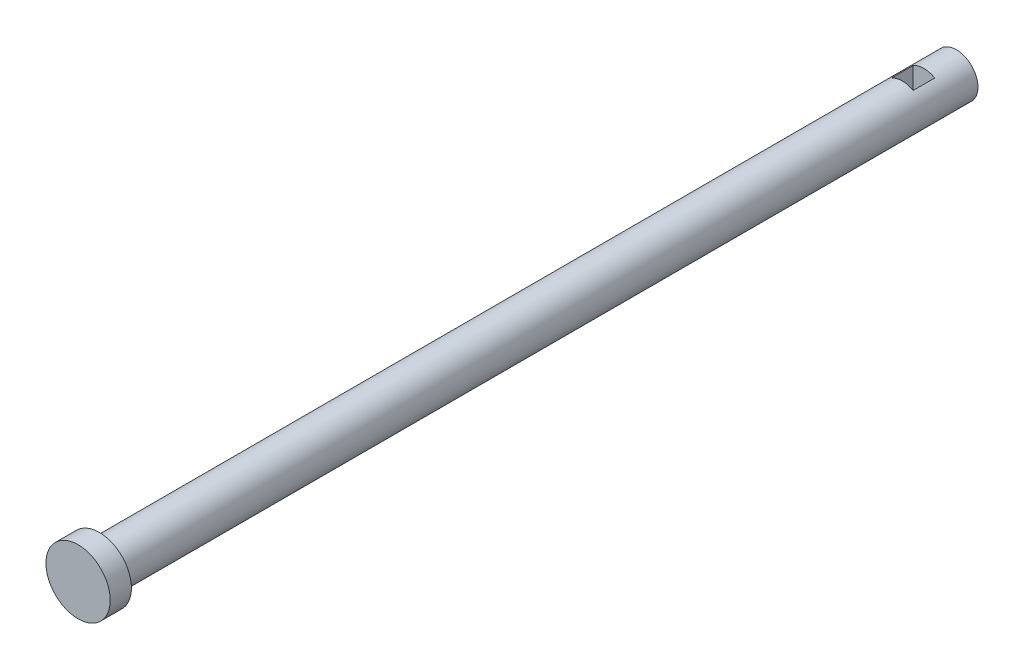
ISO-10303-21;
HEADER;
FILE_DESCRIPTION(('STEP AP214'),'2;1');
FILE_NAME('part.step','',(''),(''),'','','');
FILE_SCHEMA(('AUTOMOTIVE_DESIGN { 1 0 10303 214 1 1 1 1 }'));
ENDSEC;
DATA;
#1=APPLICATION_CONTEXT('core data for automotive mechanical design processes');
#2=APPLICATION_PROTOCOL_DEFINITION('international standard','automotive_design',2000,#1);
#3=PRODUCT_CONTEXT('',#1,'mechanical');
#4=PRODUCT('Part','Part','',(#3));
#5=PRODUCT_RELATED_PRODUCT_CATEGORY('part','',(#4));
#6=PRODUCT_DEFINITION_FORMATION('','',#4);
#7=PRODUCT_DEFINITION_CONTEXT('part definition',#1,'design');
#8=PRODUCT_DEFINITION('design','',#6,#7);
#9=PRODUCT_DEFINITION_SHAPE('','',#8);
#10=(LENGTH_UNIT() NAMED_UNIT(*) SI_UNIT(.MILLI.,.METRE.));
#11=(NAMED_UNIT(*) PLANE_ANGLE_UNIT() SI_UNIT($,.RADIAN.));
#12=(NAMED_UNIT(*) SI_UNIT($,.STERADIAN.) SOLID_ANGLE_UNIT());
#13=UNCERTAINTY_MEASURE_WITH_UNIT(LENGTH_MEASURE(1.E-05),#10,'distance_accuracy_value','');
#14=(GEOMETRIC_REPRESENTATION_CONTEXT(3) GLOBAL_UNCERTAINTY_ASSIGNED_CONTEXT((#13)) GLOBAL_UNIT_ASSIGNED_CONTEXT((#10,
#11,#12)) REPRESENTATION_CONTEXT('',''));
#15=CARTESIAN_POINT('',(0.,0.,0.));
#16=DIRECTION('',(0.,0.,1.));
#17=DIRECTION('',(1.,0.,0.));
#18=AXIS2_PLACEMENT_3D('',#15,#16,#17);
#19=CARTESIAN_POINT('',(0.,0.,395.8));
#20=DIRECTION('',(0.,0.,-1.));
#21=DIRECTION('',(-1.,0.,0.));
#22=AXIS2_PLACEMENT_3D('',#19,#20,#21);
#23=CYLINDRICAL_SURFACE('',#22,10.);
#24=CARTESIAN_POINT('',(0.,0.,15.));
#25=DIRECTION('',(0.,0.,-1.));
#26=DIRECTION('',(-1.,0.,0.));
#27=AXIS2_PLACEMENT_3D('',#24,#25,#26);
#28=CIRCLE('',#27,10.);
#29=CARTESIAN_POINT('',(-4.99999999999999,8.66025403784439,15.));
#30=VERTEX_POINT('',#29);
#31=CARTESIAN_POINT('',(5.,8.66025403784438,15.));
#32=VERTEX_POINT('',#31);
#33=EDGE_CURVE('E77',#30,#32,#28,.T.);
#34=ORIENTED_EDGE('',*,*,#33,.T.);
#35=DIRECTION('',(0.,0.,-1.));
#36=VECTOR('',#35,1.);
#37=CARTESIAN_POINT('',(5.,8.66025403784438,395.8));
#38=LINE('',#37,#36);
#39=CARTESIAN_POINT('',(5.,8.66025403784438,25.));
#40=VERTEX_POINT('',#39);
#41=EDGE_CURVE('E11',#32,#40,#38,.F.);
#42=ORIENTED_EDGE('',*,*,#41,.T.);
#43=CARTESIAN_POINT('',(0.,0.,25.));
#44=DIRECTION('',(0.,0.,1.));
#45=DIRECTION('',(1.,0.,0.));
#46=AXIS2_PLACEMENT_3D('',#43,#44,#45);
#47=CIRCLE('',#46,10.);
#48=CARTESIAN_POINT('',(-4.99999999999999,8.66025403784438,25.));
#49=VERTEX_POINT('',#48);
#50=EDGE_CURVE('E47',#40,#49,#47,.T.);
#51=ORIENTED_EDGE('',*,*,#50,.T.);
#52=DIRECTION('',(0.,0.,-1.));
#53=VECTOR('',#52,1.);
#54=CARTESIAN_POINT('',(-4.99999999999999,8.66025403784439,395.8));
#55=LINE('',#54,#53);
#56=EDGE_CURVE('E81',#49,#30,#55,.T.);
#57=ORIENTED_EDGE('',*,*,#56,.T.);
#58=EDGE_LOOP('',(#34,#42,#51,#57));
#59=FACE_BOUND('',#58,.T.);
#60=CARTESIAN_POINT('',(-4.99999999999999,-8.66025403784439,25.));
#61=VERTEX_POINT('',#60);
#62=CARTESIAN_POINT('',(5.,-8.66025403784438,25.));
#63=VERTEX_POINT('',#62);
#64=EDGE_CURVE('E97',#61,#63,#47,.T.);
#65=ORIENTED_EDGE('',*,*,#64,.T.);
#66=DIRECTION('',(0.,0.,-1.));
#67=VECTOR('',#66,1.);
#68=CARTESIAN_POINT('',(5.,-8.66025403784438,395.8));
#69=LINE('',#68,#67);
#70=CARTESIAN_POINT('',(5.,-8.66025403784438,15.));
#71=VERTEX_POINT('',#70);
#72=EDGE_CURVE('E82',#63,#71,#69,.T.);
#73=ORIENTED_EDGE('',*,*,#72,.T.);
#74=CARTESIAN_POINT('',(-4.99999999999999,-8.66025403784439,15.));
#75=VERTEX_POINT('',#74);
#76=EDGE_CURVE('E84',#71,#75,#28,.T.);
#77=ORIENTED_EDGE('',*,*,#76,.T.);
#78=DIRECTION('',(0.,0.,-1.));
#79=VECTOR('',#78,1.);
#80=CARTESIAN_POINT('',(-4.99999999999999,-8.66025403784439,395.8));
#81=LINE('',#80,#79);
#82=EDGE_CURVE('E90',#75,#61,#81,.F.);
#83=ORIENTED_EDGE('',*,*,#82,.T.);
#84=EDGE_LOOP('',(#65,#73,#77,#83));
#85=FACE_BOUND('',#84,.T.);
#86=CARTESIAN_POINT('',(0.,0.,395.8));
#87=DIRECTION('',(0.,0.,1.));
#88=DIRECTION('',(1.,0.,0.));
#89=AXIS2_PLACEMENT_3D('',#86,#87,#88);
#90=CIRCLE('',#89,10.);
#91=CARTESIAN_POINT('',(10.,0.,395.8));
#92=VERTEX_POINT('',#91);
#93=EDGE_CURVE('E103',#92,#92,#90,.T.);
#94=ORIENTED_EDGE('',*,*,#93,.F.);
#95=EDGE_LOOP('',(#94));
#96=FACE_BOUND('',#95,.T.);
#97=CARTESIAN_POINT('',(0.,0.,0.));
#98=DIRECTION('',(0.,0.,1.));
#99=DIRECTION('',(1.,0.,0.));
#100=AXIS2_PLACEMENT_3D('',#97,#98,#99);
#101=CIRCLE('',#100,10.);
#102=CARTESIAN_POINT('',(10.,0.,0.));
#103=VERTEX_POINT('',#102);
#104=EDGE_CURVE('E104',#103,#103,#101,.T.);
#105=ORIENTED_EDGE('',*,*,#104,.T.);
#106=EDGE_LOOP('',(#105));
#107=FACE_BOUND('',#106,.T.);
#108=ADVANCED_FACE('F40',(#59,#85,#96,#107),#23,.T.);
#109=CARTESIAN_POINT('',(0.,0.,0.));
#110=DIRECTION('',(0.,0.,1.));
#111=DIRECTION('',(1.,0.,0.));
#112=AXIS2_PLACEMENT_3D('',#109,#110,#111);
#113=PLANE('',#112);
#114=ORIENTED_EDGE('',*,*,#104,.F.);
#115=EDGE_LOOP('',(#114));
#116=FACE_BOUND('',#115,.T.);
#117=ADVANCED_FACE('F126',(#116),#113,.F.);
#118=CARTESIAN_POINT('',(0.,0.,405.6));
#119=DIRECTION('',(0.,0.,-1.));
#120=DIRECTION('',(-1.,0.,0.));
#121=AXIS2_PLACEMENT_3D('',#118,#119,#120);
#122=CYLINDRICAL_SURFACE('',#121,14.8407709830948);
#123=CARTESIAN_POINT('',(0.,0.,405.6));
#124=DIRECTION('',(0.,0.,1.));
#125=DIRECTION('',(1.,0.,0.));
#126=AXIS2_PLACEMENT_3D('',#123,#124,#125);
#127=CIRCLE('',#126,14.8407709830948);
#128=CARTESIAN_POINT('',(14.8407709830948,0.,405.6));
#129=VERTEX_POINT('',#128);
#130=EDGE_CURVE('E107',#129,#129,#127,.T.);
#131=ORIENTED_EDGE('',*,*,#130,.F.);
#132=EDGE_LOOP('',(#131));
#133=FACE_BOUND('',#132,.T.);
#134=CARTESIAN_POINT('',(0.,0.,395.8));
#135=DIRECTION('',(0.,0.,1.));
#136=DIRECTION('',(1.,0.,0.));
#137=AXIS2_PLACEMENT_3D('',#134,#135,#136);
#138=CIRCLE('',#137,14.8407709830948);
#139=CARTESIAN_POINT('',(14.8407709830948,0.,395.8));
#140=VERTEX_POINT('',#139);
#141=EDGE_CURVE('E110',#140,#140,#138,.T.);
#142=ORIENTED_EDGE('',*,*,#141,.T.);
#143=EDGE_LOOP('',(#142));
#144=FACE_BOUND('',#143,.T.);
#145=ADVANCED_FACE('F132',(#133,#144),#122,.T.);
#146=CARTESIAN_POINT('',(0.,0.,405.6));
#147=DIRECTION('',(0.,0.,1.));
#148=DIRECTION('',(1.,0.,0.));
#149=AXIS2_PLACEMENT_3D('',#146,#147,#148);
#150=PLANE('',#149);
#151=ORIENTED_EDGE('',*,*,#130,.T.);
#152=EDGE_LOOP('',(#151));
#153=FACE_BOUND('',#152,.T.);
#154=ADVANCED_FACE('F136',(#153),#150,.T.);
#155=CARTESIAN_POINT('',(0.,0.,395.8));
#156=DIRECTION('',(0.,0.,1.));
#157=DIRECTION('',(1.,0.,0.));
#158=AXIS2_PLACEMENT_3D('',#155,#156,#157);
#159=PLANE('',#158);
#160=ORIENTED_EDGE('',*,*,#93,.T.);
#161=EDGE_LOOP('',(#160));
#162=FACE_BOUND('',#161,.T.);
#163=ORIENTED_EDGE('',*,*,#141,.F.);
#164=EDGE_LOOP('',(#163));
#165=FACE_BOUND('',#164,.T.);
#166=ADVANCED_FACE('F140',(#162,#165),#159,.F.);
#167=CARTESIAN_POINT('',(5.00000000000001,-14.8407709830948,25.));
#168=DIRECTION('',(1.,0.,0.));
#169=DIRECTION('',(0.,0.,-1.));
#170=AXIS2_PLACEMENT_3D('',#167,#168,#169);
#171=PLANE('',#170);
#172=DIRECTION('',(0.,1.,0.));
#173=VECTOR('',#172,1.);
#174=CARTESIAN_POINT('',(5.00000000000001,-14.8407709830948,25.));
#175=LINE('',#174,#173);
#176=EDGE_CURVE('E113',#63,#40,#175,.T.);
#177=ORIENTED_EDGE('',*,*,#176,.T.);
#178=ORIENTED_EDGE('',*,*,#41,.F.);
#179=DIRECTION('',(0.,1.,0.));
#180=VECTOR('',#179,1.);
#181=CARTESIAN_POINT('',(5.00000000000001,-14.8407709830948,15.));
#182=LINE('',#181,#180);
#183=EDGE_CURVE('E54',#71,#32,#182,.T.);
#184=ORIENTED_EDGE('',*,*,#183,.F.);
#185=ORIENTED_EDGE('',*,*,#72,.F.);
#186=EDGE_LOOP('',(#177,#178,#184,#185));
#187=FACE_BOUND('',#186,.T.);
#188=ADVANCED_FACE('F121',(#187),#171,.F.);
#189=CARTESIAN_POINT('',(-4.99999999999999,-14.8407709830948,25.));
#190=DIRECTION('',(0.,0.,1.));
#191=DIRECTION('',(1.,0.,0.));
#192=AXIS2_PLACEMENT_3D('',#189,#190,#191);
#193=PLANE('',#192);
#194=ORIENTED_EDGE('',*,*,#176,.F.);
#195=ORIENTED_EDGE('',*,*,#64,.F.);
#196=DIRECTION('',(0.,1.,0.));
#197=VECTOR('',#196,1.);
#198=CARTESIAN_POINT('',(-4.99999999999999,-14.8407709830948,25.));
#199=LINE('',#198,#197);
#200=EDGE_CURVE('E92',#61,#49,#199,.T.);
#201=ORIENTED_EDGE('',*,*,#200,.T.);
#202=ORIENTED_EDGE('',*,*,#50,.F.);
#203=EDGE_LOOP('',(#194,#195,#201,#202));
#204=FACE_BOUND('',#203,.T.);
#205=ADVANCED_FACE('F123',(#204),#193,.F.);
#206=CARTESIAN_POINT('',(-4.99999999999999,-14.8407709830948,25.));
#207=DIRECTION('',(-1.,0.,0.));
#208=DIRECTION('',(0.,0.,1.));
#209=AXIS2_PLACEMENT_3D('',#206,#207,#208);
#210=PLANE('',#209);
#211=ORIENTED_EDGE('',*,*,#200,.F.);
#212=ORIENTED_EDGE('',*,*,#82,.F.);
#213=DIRECTION('',(0.,1.,0.));
#214=VECTOR('',#213,1.);
#215=CARTESIAN_POINT('',(-4.99999999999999,-14.8407709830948,15.));
#216=LINE('',#215,#214);
#217=EDGE_CURVE('E59',#75,#30,#216,.T.);
#218=ORIENTED_EDGE('',*,*,#217,.T.);
#219=ORIENTED_EDGE('',*,*,#56,.F.);
#220=EDGE_LOOP('',(#211,#212,#218,#219));
#221=FACE_BOUND('',#220,.T.);
#222=ADVANCED_FACE('F87',(#221),#210,.F.);
#223=CARTESIAN_POINT('',(-4.99999999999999,-14.8407709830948,15.));
#224=DIRECTION('',(0.,0.,-1.));
#225=DIRECTION('',(-1.,0.,0.));
#226=AXIS2_PLACEMENT_3D('',#223,#224,#225);
#227=PLANE('',#226);
#228=ORIENTED_EDGE('',*,*,#217,.F.);
#229=ORIENTED_EDGE('',*,*,#76,.F.);
#230=ORIENTED_EDGE('',*,*,#183,.T.);
#231=ORIENTED_EDGE('',*,*,#33,.F.);
#232=EDGE_LOOP('',(#228,#229,#230,#231));
#233=FACE_BOUND('',#232,.T.);
#234=ADVANCED_FACE('F78',(#233),#227,.F.);
#235=CLOSED_SHELL('',(#108,#117,#145,#154,#166,#188,#205,#222,#234));
#236=MANIFOLD_SOLID_BREP('B2',#235);
#237=ADVANCED_BREP_SHAPE_REPRESENTATION('',(#18,#236),#14);
#238=SHAPE_DEFINITION_REPRESENTATION(#9,#237);
ENDSEC;
END-ISO-10303-21;
